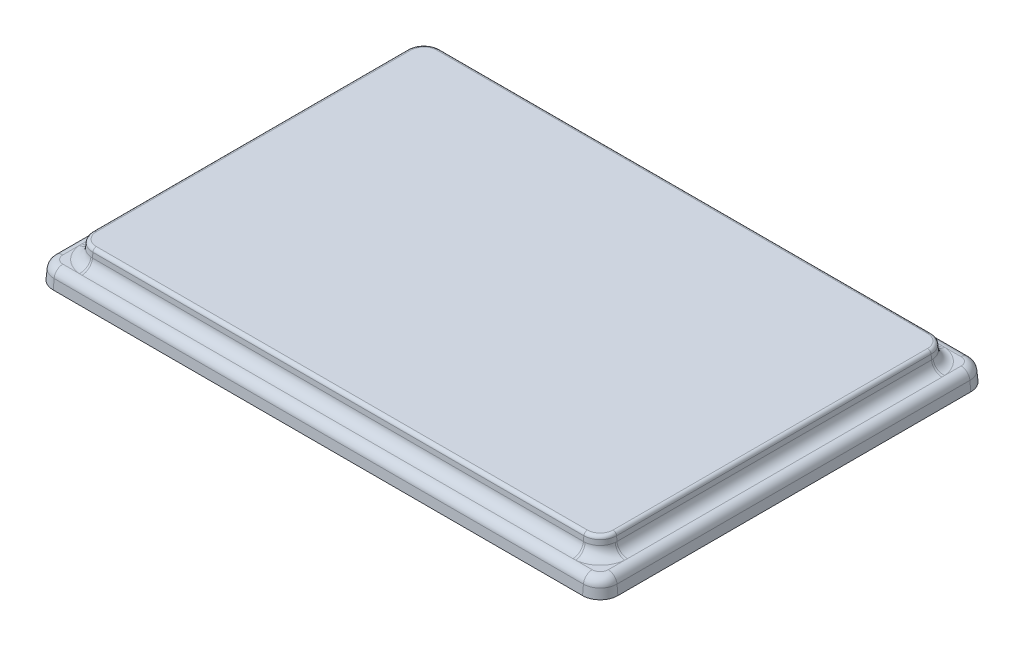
from build123d import *

# Parameters (mm, degrees)
BOSS_EXTRUDE1_DEPTH = 5
BOSS_EXTRUDE1_TAPER = 5
BOSS_EXTRUDE2_DEPTH = 5
BOSS_EXTRUDE2_TAPER = 5
FILLET1_R           = 2.5
FILLET2_R           = 3
FILLET3_R           = 1


with BuildPart() as part:
    # Sketch1 → Boss-Extrude1 (new body)
    with BuildSketch(Plane(origin=(0, 0, 0), x_dir=(1, 0, 0), z_dir=(0, 1, 0))):
        with BuildLine():
            Line((-75, -55), (75, -55))
            ThreePointArc((75, -55), (78.535533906, -53.535533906), (80, -50))
            Line((80, -50), (80, 50))
            ThreePointArc((80, 50), (78.535533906, 53.535533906), (75, 55))
            Line((75, 55), (-75, 55))
            ThreePointArc((-75, 55), (-78.535533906, 53.535533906), (-80, 50))
            Line((-80, 50), (-80, -50))
            ThreePointArc((-80, -50), (-78.535533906, -53.535533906), (-75, -55))
        make_face()
    extrude(amount=BOSS_EXTRUDE1_DEPTH, taper=BOSS_EXTRUDE1_TAPER)

    # Sketch2 → Boss-Extrude2 (add)
    with BuildSketch(Plane(origin=(0, 5, 0), x_dir=(1, 0, 0), z_dir=(0, 1, 0))):
        with BuildLine():
            Line((69.562556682, 49.562556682), (-69.562556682, 49.562556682))
            ThreePointArc((-69.562556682, 49.562556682), (-73.098090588, 48.098090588), (-74.562556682, 44.562556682))
            Line((-74.562556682, 44.562556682), (-74.562556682, -44.562556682))
            ThreePointArc((-74.562556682, -44.562556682), (-73.098090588, -48.098090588), (-69.562556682, -49.562556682))
            Line((-69.562556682, -49.562556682), (69.562556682, -49.562556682))
            ThreePointArc((69.562556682, -49.562556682), (73.098090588, -48.098090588), (74.562556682, -44.562556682))
            Line((74.562556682, -44.562556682), (74.562556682, 44.562556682))
            ThreePointArc((74.562556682, 44.562556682), (73.098090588, 48.098090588), (69.562556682, 49.562556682))
        make_face()
    extrude(amount=BOSS_EXTRUDE2_DEPTH, taper=BOSS_EXTRUDE2_TAPER)

    # Fillet1
    fillet1_edges = [part.edges().sort_by_distance(p)[0] for p in [
        (-78.22621477, 5, -53.22621477),
        (-79.562556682, 5, 0),
        (-78.22621477, 5, 53.22621477),
        (0, 5, 54.562556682),
        (78.22621477, 5, 53.22621477),
        (79.562556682, 5, 0),
        (78.22621477, 5, -53.22621477),
        (0, 5, -54.562556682),
    ]]
    fillet(fillet1_edges, radius=FILLET1_R)

    # Fillet2
    fillet2_edges = [part.edges().sort_by_distance(p)[0] for p in [
        (73.098090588, 5, 48.098090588),
        (74.562556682, 5, 0),
        (73.098090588, 5, -48.098090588),
        (0, 5, -49.562556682),
        (-73.098090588, 5, -48.098090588),
        (-74.562556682, 5, 0),
        (-73.098090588, 5, 48.098090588),
        (0, 5, 49.562556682),
    ]]
    fillet(fillet2_edges, radius=FILLET2_R)

    # Fillet3
    fillet3_edges = [part.edges().sort_by_distance(p)[0] for p in [
        (72.788771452, 10, 47.788771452),
        (74.125113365, 10, 0),
        (72.788771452, 10, -47.788771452),
        (0, 10, -49.125113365),
        (-72.788771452, 10, -47.788771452),
        (-74.125113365, 10, 0),
        (-72.788771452, 10, 47.788771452),
        (0, 10, 49.125113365),
    ]]
    fillet(fillet3_edges, radius=FILLET3_R)


solid = part.part
